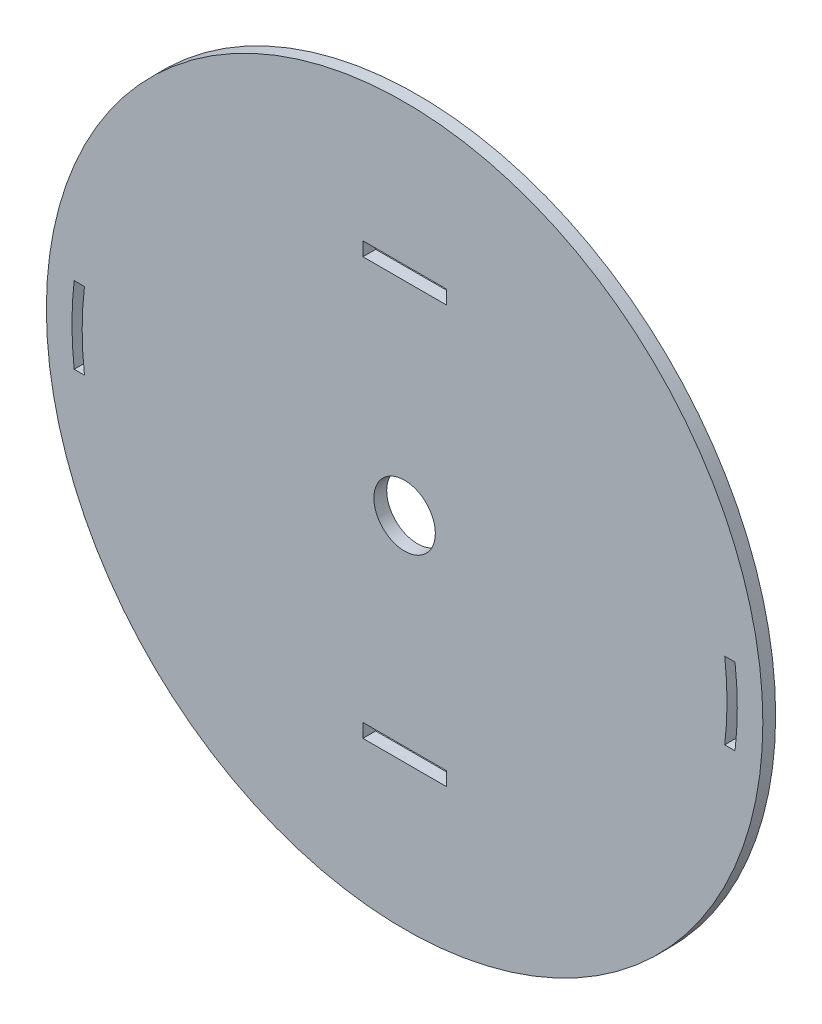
from build123d import *

# Parameters (mm, degrees)
SKETCH1_R           = 70
SKETCH1_W           = 16.298202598
SKETCH1_H           = 2.7
BOSS_EXTRUDE2_DEPTH = 2.5
SKETCH2_R           = 6
CUT_EXTRUDE1_DEPTH  = 10


with BuildPart() as part:
    # Sketch1 → Boss-Extrude2 (new body)
    with BuildSketch(Plane.XY):
        with Locations((0, 39.155307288)):
            Circle(SKETCH1_R)
        with BuildLine():
            Line((62.551978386, 31.655307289), (64.565857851, 31.655307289))
            ThreePointArc((64.565857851, 31.655307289), (65, 39.155307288), (64.565857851, 46.655307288))
            Line((64.565857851, 46.655307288), (62.551978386, 46.655307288))
            ThreePointArc((62.551978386, 46.655307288), (63, 39.155307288), (62.551978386, 31.655307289))
        make_face(mode=Mode.SUBTRACT)
        with BuildLine():
            Line((-64.565857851, 46.655307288), (-62.551978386, 46.655307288))
            ThreePointArc((-62.551978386, 46.655307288), (-63, 39.155307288), (-62.551978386, 31.655307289))
            Line((-62.551978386, 31.655307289), (-64.565857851, 31.655307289))
            ThreePointArc((-64.565857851, 31.655307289), (-65, 39.155307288), (-64.565857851, 46.655307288))
        make_face(mode=Mode.SUBTRACT)
        with Locations((0, 80.25)):
            Rectangle(SKETCH1_W, SKETCH1_H, mode=Mode.SUBTRACT)
        with Locations((0, -1.25)):
            Rectangle(SKETCH1_W, SKETCH1_H, mode=Mode.SUBTRACT)
    extrude(amount=BOSS_EXTRUDE2_DEPTH)

    # Sketch2 → Cut-Extrude1 (cut)
    with BuildSketch(Plane(origin=(0, 0, 0), x_dir=(-1, 0, 0), z_dir=(0, 0, -1))):
        with Locations((0, 39.155307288)):
            Circle(SKETCH2_R)
    extrude(amount=-CUT_EXTRUDE1_DEPTH, mode=Mode.SUBTRACT)


solid = part.part
